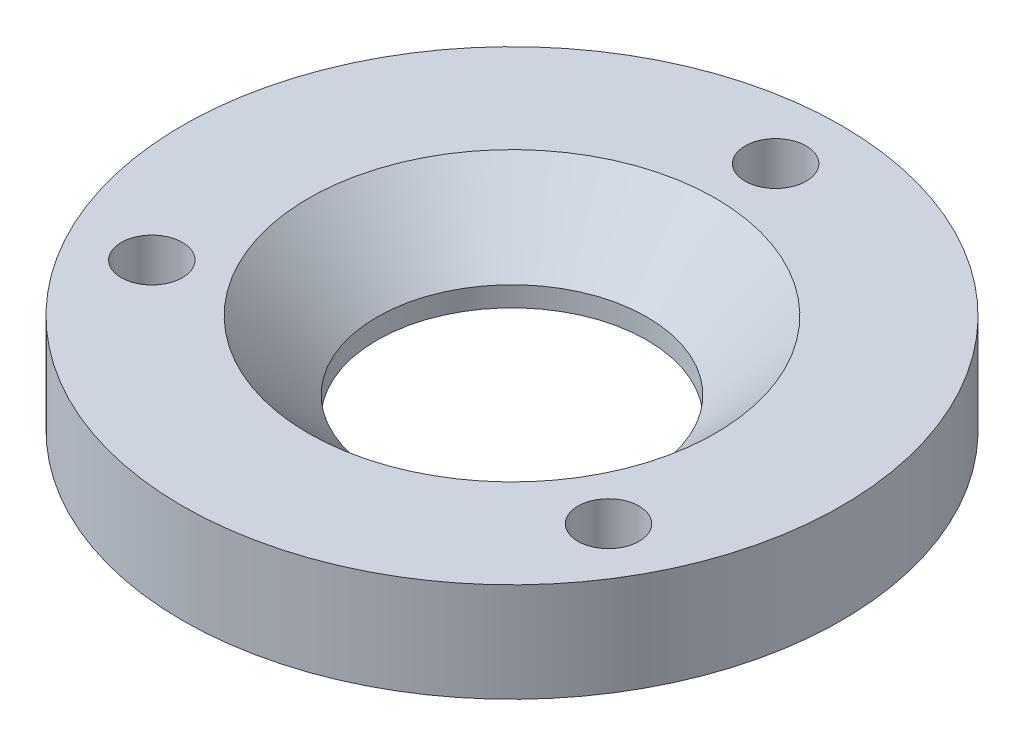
from build123d import *

# Parameters (mm, degrees)
SKETCH2_R          = 1.4732
CUT_EXTRUDE1_DEPTH = 23.952860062
CIRPATTERN1_COUNT  = 3


with BuildPart() as part:
    # Sketch1 → Revolve1 (revolve)
    with BuildSketch(Plane(origin=(0, 0, 0), x_dir=(0, 0, -1), z_dir=(1, 0, 0))):
        Polygon((-9.8044, 0), (-15.875, 0), (-15.875, -4.7752), (-10.16, -4.7752), (-10.16, -4.2672), (-6.5024, -4.2672), (-6.5024, -3.302), align=None)
    revolve(axis=Axis((0, 13.910805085, 0), (0, -1, 0)))

    # Sketch2 → Cut-Extrude1 (cut, through all)
    with BuildSketch(Plane(origin=(0, 0, 0), x_dir=(-1, 0, 0), z_dir=(0, 1, 0))):
        with Locations(Location((0, -12.7, 0), (0, 0, 90))):
            Circle(SKETCH2_R)
    cut_extrude1 = extrude(amount=-CUT_EXTRUDE1_DEPTH, mode=Mode.SUBTRACT)

    # CirPattern1: Cut-Extrude1 ×3 about axis
    cirpattern1_axis = Axis((0, 0, 0), (0, 1, 0))
    for i in range(1, CIRPATTERN1_COUNT):
        add(cut_extrude1.rotate(cirpattern1_axis, i * 360 / CIRPATTERN1_COUNT), mode=Mode.SUBTRACT)


solid = part.part
